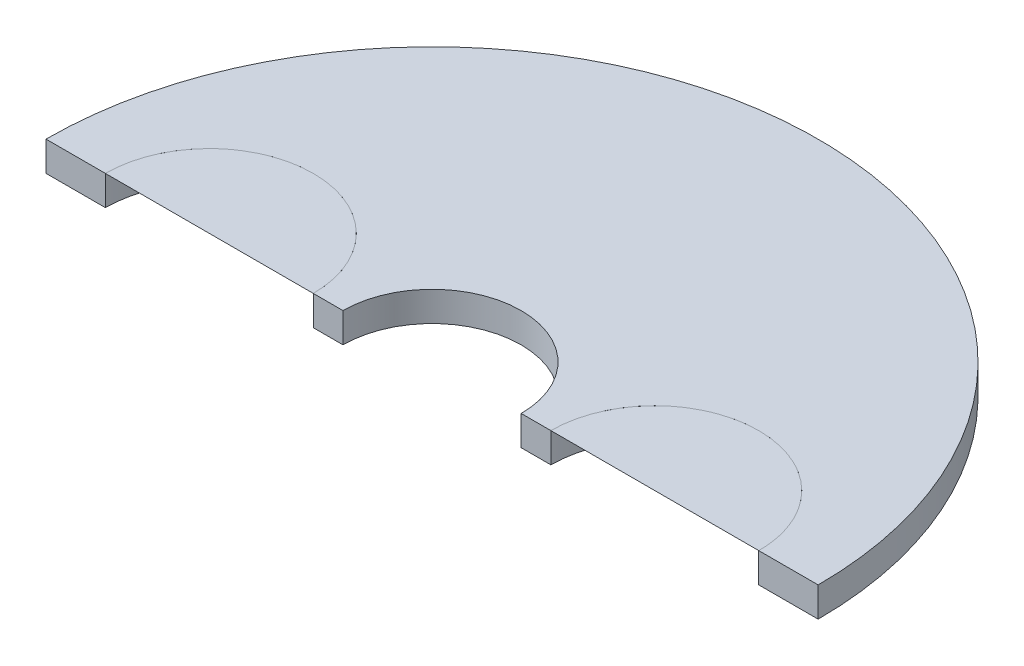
from build123d import *

# Parameters (mm, degrees)
ESQUISSE1_R      = 13
ESQUISSE1_R_2    = 3
ESQUISSE1_R_3    = 3.5
EXTRUSION1_DEPTH = 1
ESQUISSE2_W      = 13
ESQUISSE2_H      = 1
COUPE_ANGLE      = 180


with BuildPart() as part:
    # Esquisse1 → Extrusion1 (new body)
    with BuildSketch(Plane(origin=(0, 0, 0), x_dir=(1, 0, 0), z_dir=(0, 1, 0))):
        Circle(ESQUISSE1_R)
        Circle(ESQUISSE1_R_2, mode=Mode.SUBTRACT)
        with Locations((7.5, 0)):
            Circle(ESQUISSE1_R_3, mode=Mode.SUBTRACT)
        with Locations((-7.5, 0)):
            Circle(ESQUISSE1_R_3, mode=Mode.SUBTRACT)
    extrude(amount=EXTRUSION1_DEPTH)

    # Esquisse2 → Coupe (revolve, cut)
    with BuildSketch(Plane.XY):
        with Locations((6.5, 0.5)):
            Rectangle(ESQUISSE2_W, ESQUISSE2_H)
    revolve(axis=Axis((0, 0, 0), (0, -1, 0)), revolution_arc=COUPE_ANGLE, mode=Mode.SUBTRACT)


solid = part.part
